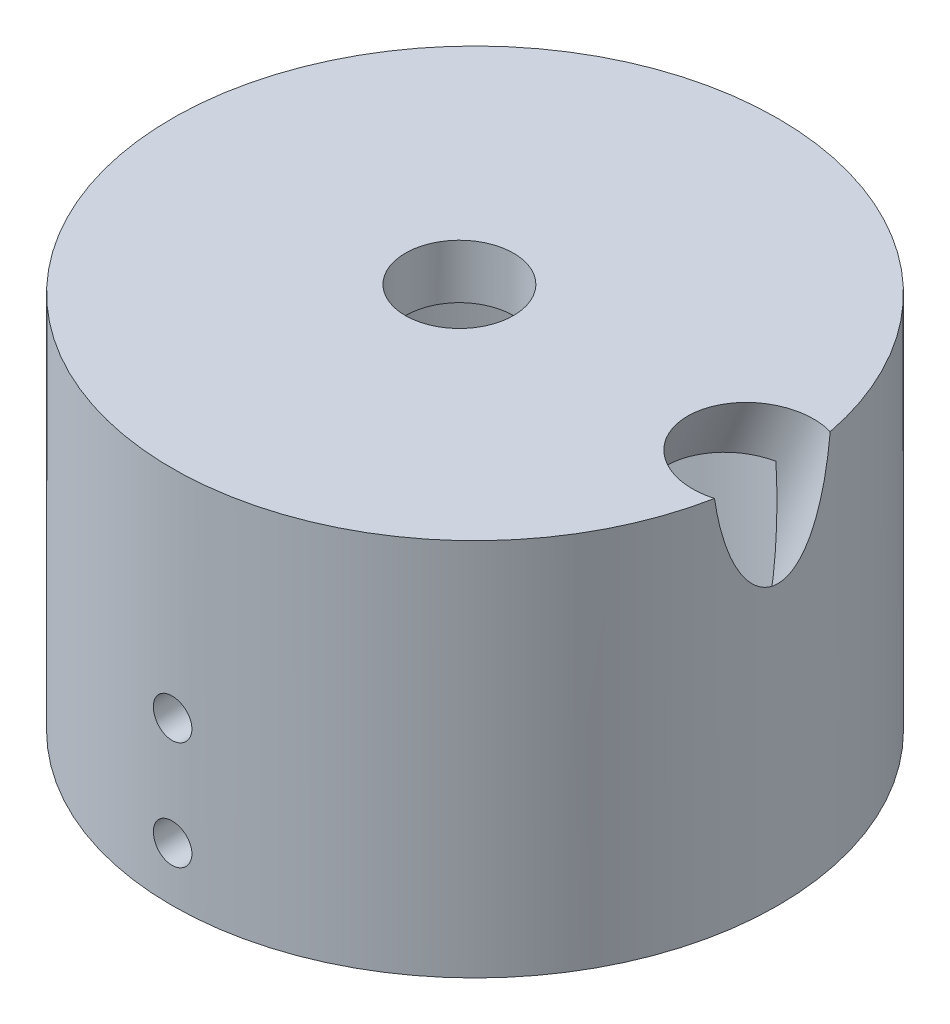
from build123d import *

# Parameters (mm, degrees)
SKETCH2_R          = 3.175
CUT_EXTRUDE1_DEPTH = 34.559014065
SKETCH4_R          = 3.556
CUT_EXTRUDE2_DEPTH = 49.238862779
SKETCH5_R          = 1.1303
CUT_EXTRUDE3_DEPTH = 34.559014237


with BuildPart() as part:
    # Sketch1 → Revolve1 (revolve)
    with BuildSketch(Plane.XY, mode=Mode.PRIVATE) as revolve1_sk:
        Polygon((0, 22.225), (17.78, 22.225), (17.78, 0), (14.605, 0), (14.605, 19.05), (0, 19.05), align=None)
    revolve(revolve1_sk.sketch.rotate(Axis((0, 0, 0), (0, 1, 0)), 90), axis=Axis((0, 0, 0), (0, 1, 0)))

    # Sketch2 → Cut-Extrude1 (cut, through all)
    with BuildSketch(Plane(origin=(0, 22.225, 0), x_dir=(1, 0, 0), z_dir=(0, 1, 0))):
        with Locations(Location((-0.9144, 0, 0), (0, 0, 270))):
            Circle(SKETCH2_R)
    extrude(amount=-CUT_EXTRUDE1_DEPTH, mode=Mode.SUBTRACT)

    # Sketch4 → Cut-Extrude2 (cut, through all)
    with BuildSketch(Plane(origin=(-6.303434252, -15.601547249, 0), x_dir=(-0.9271838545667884, 0.3746065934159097, 0), z_dir=(0.3746065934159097, 0.9271838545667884, 0))):
        with Locations(Location((-6.798472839, 0, 0), (0, 0, 107.307485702))):
            Circle(SKETCH4_R)
    extrude(amount=CUT_EXTRUDE2_DEPTH, mode=Mode.SUBTRACT)

    # Sketch5 → Cut-Extrude3 (cut, through all)
    with BuildSketch(Plane.XY):
        with Locations(Location((0, 3.175, 0), (0, 0, 180))):
            Circle(SKETCH5_R)
        with Locations(Location((0, 9.525, 0), (0, 0, 180))):
            Circle(SKETCH5_R)
    extrude(amount=CUT_EXTRUDE3_DEPTH, mode=Mode.SUBTRACT)


solid = part.part
